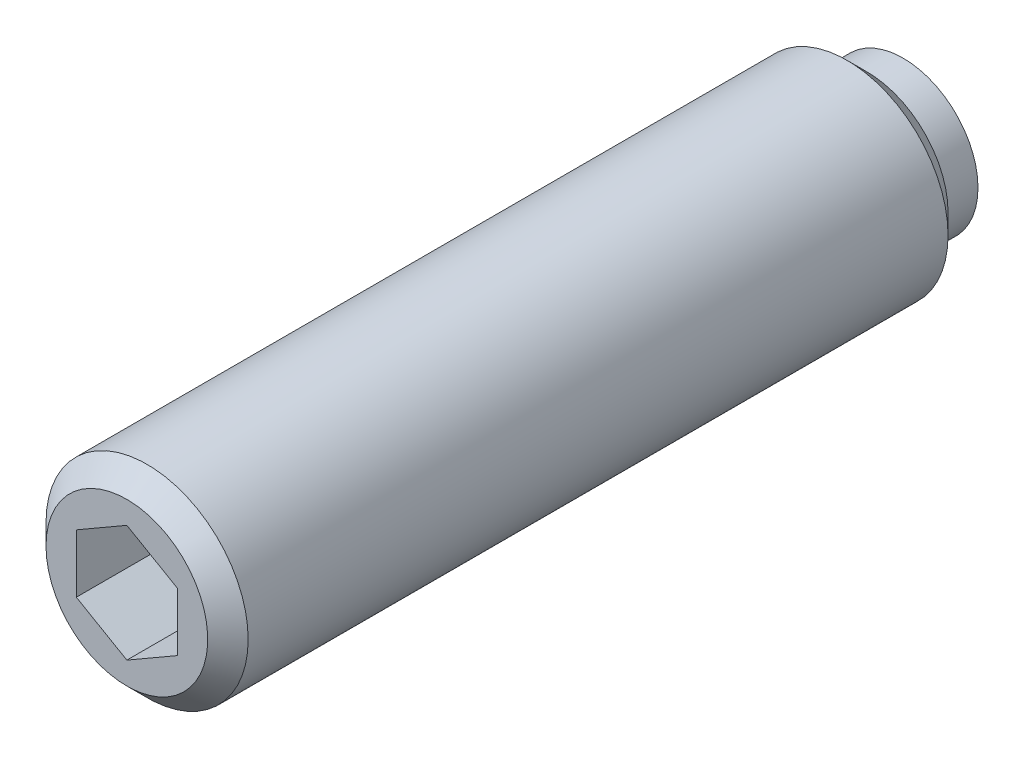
ISO-10303-21;
HEADER;
FILE_DESCRIPTION(('STEP AP214'),'2;1');
FILE_NAME('part.step','',(''),(''),'','','');
FILE_SCHEMA(('AUTOMOTIVE_DESIGN { 1 0 10303 214 1 1 1 1 }'));
ENDSEC;
DATA;
#1=APPLICATION_CONTEXT('core data for automotive mechanical design processes');
#2=APPLICATION_PROTOCOL_DEFINITION('international standard','automotive_design',2000,#1);
#3=PRODUCT_CONTEXT('',#1,'mechanical');
#4=PRODUCT('Part','Part','',(#3));
#5=PRODUCT_RELATED_PRODUCT_CATEGORY('part','',(#4));
#6=PRODUCT_DEFINITION_FORMATION('','',#4);
#7=PRODUCT_DEFINITION_CONTEXT('part definition',#1,'design');
#8=PRODUCT_DEFINITION('design','',#6,#7);
#9=PRODUCT_DEFINITION_SHAPE('','',#8);
#10=(LENGTH_UNIT() NAMED_UNIT(*) SI_UNIT(.MILLI.,.METRE.));
#11=(NAMED_UNIT(*) PLANE_ANGLE_UNIT() SI_UNIT($,.RADIAN.));
#12=(NAMED_UNIT(*) SI_UNIT($,.STERADIAN.) SOLID_ANGLE_UNIT());
#13=UNCERTAINTY_MEASURE_WITH_UNIT(LENGTH_MEASURE(1.E-05),#10,'distance_accuracy_value','');
#14=(GEOMETRIC_REPRESENTATION_CONTEXT(3) GLOBAL_UNCERTAINTY_ASSIGNED_CONTEXT((#13)) GLOBAL_UNIT_ASSIGNED_CONTEXT((#10,
#11,#12)) REPRESENTATION_CONTEXT('',''));
#15=CARTESIAN_POINT('',(0.,0.,0.));
#16=DIRECTION('',(0.,0.,1.));
#17=DIRECTION('',(1.,0.,0.));
#18=AXIS2_PLACEMENT_3D('',#15,#16,#17);
#19=CARTESIAN_POINT('',(1.25,-0.721687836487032,17.));
#20=DIRECTION('',(-0.5,0.866025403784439,0.));
#21=DIRECTION('',(0.866025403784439,0.5,0.));
#22=AXIS2_PLACEMENT_3D('',#19,#20,#21);
#23=PLANE('',#22);
#24=DIRECTION('',(0.866025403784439,0.5,0.));
#25=VECTOR('',#24,1.);
#26=CARTESIAN_POINT('',(1.25,-0.721687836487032,17.));
#27=LINE('',#26,#25);
#28=CARTESIAN_POINT('',(1.25,-0.721687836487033,17.));
#29=VERTEX_POINT('',#28);
#30=CARTESIAN_POINT('',(0.,-1.44337567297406,17.));
#31=VERTEX_POINT('',#30);
#32=EDGE_CURVE('E83',#29,#31,#27,.F.);
#33=ORIENTED_EDGE('',*,*,#32,.T.);
#34=DIRECTION('',(0.,0.,-1.));
#35=VECTOR('',#34,1.);
#36=CARTESIAN_POINT('',(0.,-1.44337567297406,17.));
#37=LINE('',#36,#35);
#38=CARTESIAN_POINT('',(0.,-1.44337567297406,20.));
#39=VERTEX_POINT('',#38);
#40=EDGE_CURVE('E81',#39,#31,#37,.T.);
#41=ORIENTED_EDGE('',*,*,#40,.F.);
#42=DIRECTION('',(0.866025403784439,0.5,0.));
#43=VECTOR('',#42,1.);
#44=CARTESIAN_POINT('',(1.25,-0.721687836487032,20.));
#45=LINE('',#44,#43);
#46=CARTESIAN_POINT('',(1.25,-0.721687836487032,20.));
#47=VERTEX_POINT('',#46);
#48=EDGE_CURVE('E67',#39,#47,#45,.T.);
#49=ORIENTED_EDGE('',*,*,#48,.T.);
#50=DIRECTION('',(0.,0.,1.));
#51=VECTOR('',#50,1.);
#52=CARTESIAN_POINT('',(1.25,-0.721687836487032,17.));
#53=LINE('',#52,#51);
#54=EDGE_CURVE('E78',#29,#47,#53,.T.);
#55=ORIENTED_EDGE('',*,*,#54,.F.);
#56=EDGE_LOOP('',(#33,#41,#49,#55));
#57=FACE_BOUND('',#56,.T.);
#58=ADVANCED_FACE('F14',(#57),#23,.T.);
#59=CARTESIAN_POINT('',(0.,-1.44337567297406,17.));
#60=DIRECTION('',(0.5,0.866025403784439,0.));
#61=DIRECTION('',(0.866025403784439,-0.5,0.));
#62=AXIS2_PLACEMENT_3D('',#59,#60,#61);
#63=PLANE('',#62);
#64=DIRECTION('',(-0.866025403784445,0.499999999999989,0.));
#65=VECTOR('',#64,1.);
#66=CARTESIAN_POINT('',(-0.625,-1.08253175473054,17.));
#67=LINE('',#66,#65);
#68=CARTESIAN_POINT('',(-1.25,-0.721687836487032,17.));
#69=VERTEX_POINT('',#68);
#70=EDGE_CURVE('E74',#31,#69,#67,.T.);
#71=ORIENTED_EDGE('',*,*,#70,.T.);
#72=DIRECTION('',(0.,0.,-1.));
#73=VECTOR('',#72,1.);
#74=CARTESIAN_POINT('',(-1.25,-0.721687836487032,17.));
#75=LINE('',#74,#73);
#76=CARTESIAN_POINT('',(-1.25,-0.721687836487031,20.));
#77=VERTEX_POINT('',#76);
#78=EDGE_CURVE('E90',#77,#69,#75,.T.);
#79=ORIENTED_EDGE('',*,*,#78,.F.);
#80=DIRECTION('',(0.866025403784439,-0.5,0.));
#81=VECTOR('',#80,1.);
#82=CARTESIAN_POINT('',(0.,-1.44337567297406,20.));
#83=LINE('',#82,#81);
#84=EDGE_CURVE('E96',#77,#39,#83,.T.);
#85=ORIENTED_EDGE('',*,*,#84,.T.);
#86=ORIENTED_EDGE('',*,*,#40,.T.);
#87=EDGE_LOOP('',(#71,#79,#85,#86));
#88=FACE_BOUND('',#87,.T.);
#89=ADVANCED_FACE('F178',(#88),#63,.T.);
#90=CARTESIAN_POINT('',(1.25,0.721687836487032,17.));
#91=DIRECTION('',(-1.,0.,0.));
#92=DIRECTION('',(0.,0.,1.));
#93=AXIS2_PLACEMENT_3D('',#90,#91,#92);
#94=PLANE('',#93);
#95=DIRECTION('',(0.,1.,0.));
#96=VECTOR('',#95,1.);
#97=CARTESIAN_POINT('',(1.25,0.721687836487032,17.));
#98=LINE('',#97,#96);
#99=CARTESIAN_POINT('',(1.25,0.721687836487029,17.));
#100=VERTEX_POINT('',#99);
#101=EDGE_CURVE('E73',#100,#29,#98,.F.);
#102=ORIENTED_EDGE('',*,*,#101,.T.);
#103=ORIENTED_EDGE('',*,*,#54,.T.);
#104=DIRECTION('',(0.,1.,0.));
#105=VECTOR('',#104,1.);
#106=CARTESIAN_POINT('',(1.25,0.721687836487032,20.));
#107=LINE('',#106,#105);
#108=CARTESIAN_POINT('',(1.25,0.721687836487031,20.));
#109=VERTEX_POINT('',#108);
#110=EDGE_CURVE('E63',#47,#109,#107,.T.);
#111=ORIENTED_EDGE('',*,*,#110,.T.);
#112=DIRECTION('',(0.,0.,-1.));
#113=VECTOR('',#112,1.);
#114=CARTESIAN_POINT('',(1.25,0.721687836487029,17.));
#115=LINE('',#114,#113);
#116=EDGE_CURVE('E105',#100,#109,#115,.F.);
#117=ORIENTED_EDGE('',*,*,#116,.F.);
#118=EDGE_LOOP('',(#102,#103,#111,#117));
#119=FACE_BOUND('',#118,.T.);
#120=ADVANCED_FACE('F86',(#119),#94,.T.);
#121=CARTESIAN_POINT('',(-1.25,-0.721687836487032,17.));
#122=DIRECTION('',(1.,0.,0.));
#123=DIRECTION('',(0.,0.,-1.));
#124=AXIS2_PLACEMENT_3D('',#121,#122,#123);
#125=PLANE('',#124);
#126=DIRECTION('',(0.,1.,0.));
#127=VECTOR('',#126,1.);
#128=CARTESIAN_POINT('',(-1.25,0.,17.));
#129=LINE('',#128,#127);
#130=CARTESIAN_POINT('',(-1.25,0.721687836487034,17.));
#131=VERTEX_POINT('',#130);
#132=EDGE_CURVE('E102',#69,#131,#129,.T.);
#133=ORIENTED_EDGE('',*,*,#132,.T.);
#134=DIRECTION('',(0.,0.,-1.));
#135=VECTOR('',#134,1.);
#136=CARTESIAN_POINT('',(-1.25,0.721687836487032,17.));
#137=LINE('',#136,#135);
#138=CARTESIAN_POINT('',(-1.25,0.721687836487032,20.));
#139=VERTEX_POINT('',#138);
#140=EDGE_CURVE('E107',#139,#131,#137,.T.);
#141=ORIENTED_EDGE('',*,*,#140,.F.);
#142=DIRECTION('',(0.,1.,0.));
#143=VECTOR('',#142,1.);
#144=CARTESIAN_POINT('',(-1.25,-0.721687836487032,20.));
#145=LINE('',#144,#143);
#146=EDGE_CURVE('E87',#139,#77,#145,.F.);
#147=ORIENTED_EDGE('',*,*,#146,.T.);
#148=ORIENTED_EDGE('',*,*,#78,.T.);
#149=EDGE_LOOP('',(#133,#141,#147,#148));
#150=FACE_BOUND('',#149,.T.);
#151=ADVANCED_FACE('F185',(#150),#125,.T.);
#152=CARTESIAN_POINT('',(0.,0.,17.));
#153=DIRECTION('',(0.,0.,-1.));
#154=DIRECTION('',(-1.,0.,0.));
#155=AXIS2_PLACEMENT_3D('',#152,#153,#154);
#156=PLANE('',#155);
#157=DIRECTION('',(-0.866025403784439,0.5,0.));
#158=VECTOR('',#157,1.);
#159=CARTESIAN_POINT('',(0.,1.44337567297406,17.));
#160=LINE('',#159,#158);
#161=CARTESIAN_POINT('',(0.,1.44337567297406,17.));
#162=VERTEX_POINT('',#161);
#163=EDGE_CURVE('E108',#162,#100,#160,.F.);
#164=ORIENTED_EDGE('',*,*,#163,.F.);
#165=DIRECTION('',(-0.866025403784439,-0.5,0.));
#166=VECTOR('',#165,1.);
#167=CARTESIAN_POINT('',(-1.25,0.721687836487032,17.));
#168=LINE('',#167,#166);
#169=EDGE_CURVE('E117',#131,#162,#168,.F.);
#170=ORIENTED_EDGE('',*,*,#169,.F.);
#171=ORIENTED_EDGE('',*,*,#132,.F.);
#172=ORIENTED_EDGE('',*,*,#70,.F.);
#173=ORIENTED_EDGE('',*,*,#32,.F.);
#174=ORIENTED_EDGE('',*,*,#101,.F.);
#175=EDGE_LOOP('',(#164,#170,#171,#172,#173,#174));
#176=FACE_BOUND('',#175,.T.);
#177=ADVANCED_FACE('F190',(#176),#156,.F.);
#178=CARTESIAN_POINT('',(0.,1.44337567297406,17.));
#179=DIRECTION('',(-0.5,-0.866025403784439,0.));
#180=DIRECTION('',(-0.866025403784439,0.5,0.));
#181=AXIS2_PLACEMENT_3D('',#178,#179,#180);
#182=PLANE('',#181);
#183=ORIENTED_EDGE('',*,*,#163,.T.);
#184=ORIENTED_EDGE('',*,*,#116,.T.);
#185=DIRECTION('',(-0.866025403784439,0.5,0.));
#186=VECTOR('',#185,1.);
#187=CARTESIAN_POINT('',(0.,1.44337567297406,20.));
#188=LINE('',#187,#186);
#189=CARTESIAN_POINT('',(0.,1.44337567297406,20.));
#190=VERTEX_POINT('',#189);
#191=EDGE_CURVE('E31',#109,#190,#188,.T.);
#192=ORIENTED_EDGE('',*,*,#191,.T.);
#193=DIRECTION('',(0.,0.,-1.));
#194=VECTOR('',#193,1.);
#195=CARTESIAN_POINT('',(0.,1.44337567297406,17.));
#196=LINE('',#195,#194);
#197=EDGE_CURVE('E113',#162,#190,#196,.F.);
#198=ORIENTED_EDGE('',*,*,#197,.F.);
#199=EDGE_LOOP('',(#183,#184,#192,#198));
#200=FACE_BOUND('',#199,.T.);
#201=ADVANCED_FACE('F194',(#200),#182,.T.);
#202=CARTESIAN_POINT('',(-1.25,0.721687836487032,17.));
#203=DIRECTION('',(0.5,-0.866025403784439,0.));
#204=DIRECTION('',(-0.866025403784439,-0.5,0.));
#205=AXIS2_PLACEMENT_3D('',#202,#203,#204);
#206=PLANE('',#205);
#207=ORIENTED_EDGE('',*,*,#169,.T.);
#208=ORIENTED_EDGE('',*,*,#197,.T.);
#209=DIRECTION('',(-0.86602540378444,-0.5,0.));
#210=VECTOR('',#209,1.);
#211=CARTESIAN_POINT('',(0.,1.44337567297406,20.));
#212=LINE('',#211,#210);
#213=EDGE_CURVE('E111',#190,#139,#212,.T.);
#214=ORIENTED_EDGE('',*,*,#213,.T.);
#215=ORIENTED_EDGE('',*,*,#140,.T.);
#216=EDGE_LOOP('',(#207,#208,#214,#215));
#217=FACE_BOUND('',#216,.T.);
#218=ADVANCED_FACE('F198',(#217),#206,.T.);
#219=CARTESIAN_POINT('',(0.,0.,20.));
#220=DIRECTION('',(0.,0.,-1.));
#221=DIRECTION('',(-1.,0.,0.));
#222=AXIS2_PLACEMENT_3D('',#219,#220,#221);
#223=PLANE('',#222);
#224=ORIENTED_EDGE('',*,*,#191,.F.);
#225=ORIENTED_EDGE('',*,*,#110,.F.);
#226=ORIENTED_EDGE('',*,*,#48,.F.);
#227=ORIENTED_EDGE('',*,*,#84,.F.);
#228=ORIENTED_EDGE('',*,*,#146,.F.);
#229=ORIENTED_EDGE('',*,*,#213,.F.);
#230=EDGE_LOOP('',(#224,#225,#226,#227,#228,#229));
#231=FACE_BOUND('',#230,.T.);
#232=CARTESIAN_POINT('',(0.,0.,20.));
#233=DIRECTION('',(0.,0.,-1.));
#234=DIRECTION('',(-1.,0.,0.));
#235=AXIS2_PLACEMENT_3D('',#232,#233,#234);
#236=CIRCLE('',#235,1.9999999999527);
#237=CARTESIAN_POINT('',(-1.99999999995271,0.,20.));
#238=VERTEX_POINT('',#237);
#239=EDGE_CURVE('E17',#238,#238,#236,.T.);
#240=ORIENTED_EDGE('',*,*,#239,.F.);
#241=EDGE_LOOP('',(#240));
#242=FACE_BOUND('',#241,.T.);
#243=ADVANCED_FACE('F65',(#231,#242),#223,.F.);
#244=CARTESIAN_POINT('',(0.,0.,19.4999999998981));
#245=DIRECTION('',(0.,0.,-1.));
#246=DIRECTION('',(-1.,0.,0.));
#247=AXIS2_PLACEMENT_3D('',#244,#245,#246);
#248=CONICAL_SURFACE('',#247,2.50000000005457,0.785398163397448);
#249=ORIENTED_EDGE('',*,*,#239,.T.);
#250=EDGE_LOOP('',(#249));
#251=FACE_BOUND('',#250,.T.);
#252=CARTESIAN_POINT('',(0.,0.,19.5));
#253=DIRECTION('',(0.,0.,1.));
#254=DIRECTION('',(1.,0.,0.));
#255=AXIS2_PLACEMENT_3D('',#252,#253,#254);
#256=CIRCLE('',#255,2.5);
#257=CARTESIAN_POINT('',(2.5,0.,19.5));
#258=VERTEX_POINT('',#257);
#259=EDGE_CURVE('E9',#258,#258,#256,.F.);
#260=ORIENTED_EDGE('',*,*,#259,.F.);
#261=EDGE_LOOP('',(#260));
#262=FACE_BOUND('',#261,.T.);
#263=ADVANCED_FACE('F174',(#251,#262),#248,.T.);
#264=CARTESIAN_POINT('',(0.,0.,12.8));
#265=DIRECTION('',(0.,0.,1.));
#266=DIRECTION('',(1.,0.,0.));
#267=AXIS2_PLACEMENT_3D('',#264,#265,#266);
#268=CYLINDRICAL_SURFACE('',#267,2.5);
#269=ORIENTED_EDGE('',*,*,#259,.T.);
#270=EDGE_LOOP('',(#269));
#271=FACE_BOUND('',#270,.T.);
#272=CARTESIAN_POINT('',(0.,0.,2.19050000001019));
#273=DIRECTION('',(0.,0.,1.));
#274=DIRECTION('',(1.,0.,0.));
#275=AXIS2_PLACEMENT_3D('',#272,#273,#274);
#276=CIRCLE('',#275,2.49999999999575);
#277=CARTESIAN_POINT('',(2.49999999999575,0.,2.19050000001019));
#278=VERTEX_POINT('',#277);
#279=EDGE_CURVE('E137',#278,#278,#276,.T.);
#280=ORIENTED_EDGE('',*,*,#279,.T.);
#281=EDGE_LOOP('',(#280));
#282=FACE_BOUND('',#281,.T.);
#283=ADVANCED_FACE('F141',(#271,#282),#268,.T.);
#284=CARTESIAN_POINT('',(0.,0.,1.5));
#285=DIRECTION('',(0.,0.,1.));
#286=DIRECTION('',(-1.,0.,0.));
#287=AXIS2_PLACEMENT_3D('',#284,#285,#286);
#288=SPHERICAL_SURFACE('',#287,1.5);
#289=CARTESIAN_POINT('',(0.,0.,0.8));
#290=DIRECTION('',(0.,0.,1.));
#291=DIRECTION('',(1.,0.,0.));
#292=AXIS2_PLACEMENT_3D('',#289,#290,#291);
#293=CIRCLE('',#292,1.32664991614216);
#294=CARTESIAN_POINT('',(1.32664991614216,0.,0.8));
#295=VERTEX_POINT('',#294);
#296=EDGE_CURVE('E84',#295,#295,#293,.T.);
#297=ORIENTED_EDGE('',*,*,#296,.F.);
#298=EDGE_LOOP('',(#297));
#299=FACE_BOUND('',#298,.T.);
#300=ADVANCED_FACE('F164',(#299),#288,.T.);
#301=CARTESIAN_POINT('',(-1.32664991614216,0.,0.8));
#302=DIRECTION('',(0.,0.,1.));
#303=DIRECTION('',(1.,0.,0.));
#304=AXIS2_PLACEMENT_3D('',#301,#302,#303);
#305=PLANE('',#304);
#306=CARTESIAN_POINT('',(0.,0.,0.8));
#307=DIRECTION('',(0.,0.,1.));
#308=DIRECTION('',(1.,0.,0.));
#309=AXIS2_PLACEMENT_3D('',#306,#307,#308);
#310=CIRCLE('',#309,1.85);
#311=CARTESIAN_POINT('',(1.85,0.,0.8));
#312=VERTEX_POINT('',#311);
#313=EDGE_CURVE('E128',#312,#312,#310,.T.);
#314=ORIENTED_EDGE('',*,*,#313,.F.);
#315=EDGE_LOOP('',(#314));
#316=FACE_BOUND('',#315,.T.);
#317=ORIENTED_EDGE('',*,*,#296,.T.);
#318=EDGE_LOOP('',(#317));
#319=FACE_BOUND('',#318,.T.);
#320=ADVANCED_FACE('F158',(#316,#319),#305,.F.);
#321=CARTESIAN_POINT('',(0.,0.,22.8654961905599));
#322=DIRECTION('',(0.,0.,1.));
#323=DIRECTION('',(1.,0.,0.));
#324=AXIS2_PLACEMENT_3D('',#321,#322,#323);
#325=CYLINDRICAL_SURFACE('',#324,1.85);
#326=CARTESIAN_POINT('',(0.,0.,1.7));
#327=DIRECTION('',(0.,0.,1.));
#328=DIRECTION('',(1.,0.,0.));
#329=AXIS2_PLACEMENT_3D('',#326,#327,#328);
#330=CIRCLE('',#329,1.85);
#331=CARTESIAN_POINT('',(1.85,0.,1.7));
#332=VERTEX_POINT('',#331);
#333=EDGE_CURVE('E131',#332,#332,#330,.T.);
#334=ORIENTED_EDGE('',*,*,#333,.F.);
#335=EDGE_LOOP('',(#334));
#336=FACE_BOUND('',#335,.T.);
#337=ORIENTED_EDGE('',*,*,#313,.T.);
#338=EDGE_LOOP('',(#337));
#339=FACE_BOUND('',#338,.T.);
#340=ADVANCED_FACE('F152',(#336,#339),#325,.T.);
#341=CARTESIAN_POINT('',(-2.00949999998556,0.,1.7));
#342=DIRECTION('',(0.,0.,1.));
#343=DIRECTION('',(1.,0.,0.));
#344=AXIS2_PLACEMENT_3D('',#341,#342,#343);
#345=PLANE('',#344);
#346=CARTESIAN_POINT('',(0.,0.,1.7));
#347=DIRECTION('',(0.,0.,1.));
#348=DIRECTION('',(1.,0.,0.));
#349=AXIS2_PLACEMENT_3D('',#346,#347,#348);
#350=CIRCLE('',#349,2.00949999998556);
#351=CARTESIAN_POINT('',(2.00949999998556,0.,1.7));
#352=VERTEX_POINT('',#351);
#353=EDGE_CURVE('E134',#352,#352,#350,.T.);
#354=ORIENTED_EDGE('',*,*,#353,.F.);
#355=EDGE_LOOP('',(#354));
#356=FACE_BOUND('',#355,.T.);
#357=ORIENTED_EDGE('',*,*,#333,.T.);
#358=EDGE_LOOP('',(#357));
#359=FACE_BOUND('',#358,.T.);
#360=ADVANCED_FACE('F146',(#356,#359),#345,.F.);
#361=CARTESIAN_POINT('',(0.,0.,1.7));
#362=DIRECTION('',(0.,0.,1.));
#363=DIRECTION('',(1.,0.,0.));
#364=AXIS2_PLACEMENT_3D('',#361,#362,#363);
#365=CONICAL_SURFACE('',#364,2.00949999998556,0.785398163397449);
#366=ORIENTED_EDGE('',*,*,#279,.F.);
#367=EDGE_LOOP('',(#366));
#368=FACE_BOUND('',#367,.T.);
#369=ORIENTED_EDGE('',*,*,#353,.T.);
#370=EDGE_LOOP('',(#369));
#371=FACE_BOUND('',#370,.T.);
#372=ADVANCED_FACE('F143',(#368,#371),#365,.T.);
#373=CLOSED_SHELL('',(#58,#89,#120,#151,#177,#201,#218,#243,#263,#283,#300,#320,#340,#360,#372));
#374=MANIFOLD_SOLID_BREP('B1',#373);
#375=ADVANCED_BREP_SHAPE_REPRESENTATION('',(#18,#374),#14);
#376=SHAPE_DEFINITION_REPRESENTATION(#9,#375);
ENDSEC;
END-ISO-10303-21;
